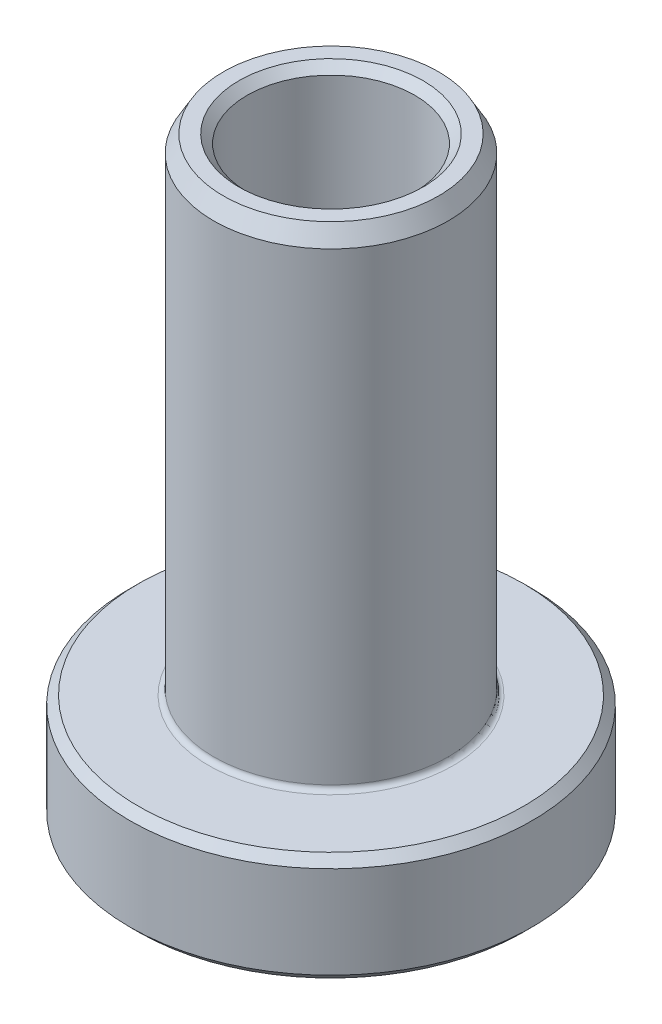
ISO-10303-21;
HEADER;
FILE_DESCRIPTION(('STEP AP214'),'2;1');
FILE_NAME('part.step','',(''),(''),'','','');
FILE_SCHEMA(('AUTOMOTIVE_DESIGN { 1 0 10303 214 1 1 1 1 }'));
ENDSEC;
DATA;
#1=APPLICATION_CONTEXT('core data for automotive mechanical design processes');
#2=APPLICATION_PROTOCOL_DEFINITION('international standard','automotive_design',2000,#1);
#3=PRODUCT_CONTEXT('',#1,'mechanical');
#4=PRODUCT('Part','Part','',(#3));
#5=PRODUCT_RELATED_PRODUCT_CATEGORY('part','',(#4));
#6=PRODUCT_DEFINITION_FORMATION('','',#4);
#7=PRODUCT_DEFINITION_CONTEXT('part definition',#1,'design');
#8=PRODUCT_DEFINITION('design','',#6,#7);
#9=PRODUCT_DEFINITION_SHAPE('','',#8);
#10=(LENGTH_UNIT() NAMED_UNIT(*) SI_UNIT(.MILLI.,.METRE.));
#11=(NAMED_UNIT(*) PLANE_ANGLE_UNIT() SI_UNIT($,.RADIAN.));
#12=(NAMED_UNIT(*) SI_UNIT($,.STERADIAN.) SOLID_ANGLE_UNIT());
#13=UNCERTAINTY_MEASURE_WITH_UNIT(LENGTH_MEASURE(1.E-05),#10,'distance_accuracy_value','');
#14=(GEOMETRIC_REPRESENTATION_CONTEXT(3) GLOBAL_UNCERTAINTY_ASSIGNED_CONTEXT((#13)) GLOBAL_UNIT_ASSIGNED_CONTEXT((#10,
#11,#12)) REPRESENTATION_CONTEXT('',''));
#15=CARTESIAN_POINT('',(0.,0.,0.));
#16=DIRECTION('',(0.,0.,1.));
#17=DIRECTION('',(1.,0.,0.));
#18=AXIS2_PLACEMENT_3D('',#15,#16,#17);
#19=CARTESIAN_POINT('',(0.,48.5159618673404,0.));
#20=DIRECTION('',(0.,1.,0.));
#21=DIRECTION('',(0.,0.,1.));
#22=AXIS2_PLACEMENT_3D('',#19,#20,#21);
#23=CYLINDRICAL_SURFACE('',#22,5.);
#24=CARTESIAN_POINT('',(0.,35.,0.));
#25=DIRECTION('',(0.,-1.,0.));
#26=DIRECTION('',(0.,0.,-1.));
#27=AXIS2_PLACEMENT_3D('',#24,#25,#26);
#28=CIRCLE('',#27,5.);
#29=CARTESIAN_POINT('',(0.,35.,-5.));
#30=VERTEX_POINT('',#29);
#31=EDGE_CURVE('E51',#30,#30,#28,.F.);
#32=ORIENTED_EDGE('',*,*,#31,.T.);
#33=EDGE_LOOP('',(#32));
#34=FACE_BOUND('',#33,.T.);
#35=CARTESIAN_POINT('',(0.,0.5,0.));
#36=DIRECTION('',(0.,1.,0.));
#37=DIRECTION('',(0.,0.,1.));
#38=AXIS2_PLACEMENT_3D('',#35,#36,#37);
#39=CIRCLE('',#38,5.);
#40=CARTESIAN_POINT('',(0.,0.5,5.));
#41=VERTEX_POINT('',#40);
#42=EDGE_CURVE('E54',#41,#41,#39,.F.);
#43=ORIENTED_EDGE('',*,*,#42,.T.);
#44=EDGE_LOOP('',(#43));
#45=FACE_BOUND('',#44,.T.);
#46=ADVANCED_FACE('F26',(#34,#45),#23,.F.);
#47=CARTESIAN_POINT('',(5.,0.,0.));
#48=DIRECTION('',(0.,1.,0.));
#49=DIRECTION('',(0.,0.,1.));
#50=AXIS2_PLACEMENT_3D('',#47,#48,#49);
#51=PLANE('',#50);
#52=CARTESIAN_POINT('',(0.,0.,0.));
#53=DIRECTION('',(0.,1.,0.));
#54=DIRECTION('',(0.,0.,1.));
#55=AXIS2_PLACEMENT_3D('',#52,#53,#54);
#56=CIRCLE('',#55,11.5);
#57=CARTESIAN_POINT('',(0.,0.,11.5));
#58=VERTEX_POINT('',#57);
#59=EDGE_CURVE('E10',#58,#58,#56,.F.);
#60=ORIENTED_EDGE('',*,*,#59,.T.);
#61=EDGE_LOOP('',(#60));
#62=FACE_BOUND('',#61,.T.);
#63=CARTESIAN_POINT('',(0.,0.,0.));
#64=DIRECTION('',(0.,1.,0.));
#65=DIRECTION('',(0.,0.,1.));
#66=AXIS2_PLACEMENT_3D('',#63,#64,#65);
#67=CIRCLE('',#66,5.50000000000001);
#68=CARTESIAN_POINT('',(0.,0.,5.50000000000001));
#69=VERTEX_POINT('',#68);
#70=EDGE_CURVE('E32',#69,#69,#67,.T.);
#71=ORIENTED_EDGE('',*,*,#70,.T.);
#72=EDGE_LOOP('',(#71));
#73=FACE_BOUND('',#72,.T.);
#74=ADVANCED_FACE('F89',(#62,#73),#51,.F.);
#75=CARTESIAN_POINT('',(0.,48.5159618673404,0.));
#76=DIRECTION('',(0.,1.,0.));
#77=DIRECTION('',(0.,0.,1.));
#78=AXIS2_PLACEMENT_3D('',#75,#76,#77);
#79=CYLINDRICAL_SURFACE('',#78,12.);
#80=CARTESIAN_POINT('',(0.,6.,0.));
#81=DIRECTION('',(0.,-1.,0.));
#82=DIRECTION('',(0.,0.,-1.));
#83=AXIS2_PLACEMENT_3D('',#80,#81,#82);
#84=CIRCLE('',#83,12.);
#85=CARTESIAN_POINT('',(0.,6.,-12.));
#86=VERTEX_POINT('',#85);
#87=EDGE_CURVE('E36',#86,#86,#84,.T.);
#88=ORIENTED_EDGE('',*,*,#87,.T.);
#89=EDGE_LOOP('',(#88));
#90=FACE_BOUND('',#89,.T.);
#91=CARTESIAN_POINT('',(0.,0.500000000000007,0.));
#92=DIRECTION('',(0.,1.,0.));
#93=DIRECTION('',(0.,0.,1.));
#94=AXIS2_PLACEMENT_3D('',#91,#92,#93);
#95=CIRCLE('',#94,12.);
#96=CARTESIAN_POINT('',(0.,0.500000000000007,12.));
#97=VERTEX_POINT('',#96);
#98=EDGE_CURVE('E40',#97,#97,#95,.T.);
#99=ORIENTED_EDGE('',*,*,#98,.T.);
#100=EDGE_LOOP('',(#99));
#101=FACE_BOUND('',#100,.T.);
#102=ADVANCED_FACE('F94',(#90,#101),#79,.T.);
#103=CARTESIAN_POINT('',(12.,6.5,0.));
#104=DIRECTION('',(0.,-1.,0.));
#105=DIRECTION('',(0.,0.,-1.));
#106=AXIS2_PLACEMENT_3D('',#103,#104,#105);
#107=PLANE('',#106);
#108=CARTESIAN_POINT('',(0.,6.5,0.));
#109=DIRECTION('',(0.,-1.,0.));
#110=DIRECTION('',(0.,0.,-1.));
#111=AXIS2_PLACEMENT_3D('',#108,#109,#110);
#112=CIRCLE('',#111,11.5);
#113=CARTESIAN_POINT('',(0.,6.5,-11.5));
#114=VERTEX_POINT('',#113);
#115=EDGE_CURVE('E45',#114,#114,#112,.F.);
#116=ORIENTED_EDGE('',*,*,#115,.T.);
#117=EDGE_LOOP('',(#116));
#118=FACE_BOUND('',#117,.T.);
#119=CARTESIAN_POINT('',(0.,6.5,0.));
#120=DIRECTION('',(0.,-1.,0.));
#121=DIRECTION('',(0.,0.,-1.));
#122=AXIS2_PLACEMENT_3D('',#119,#120,#121);
#123=CIRCLE('',#122,7.3);
#124=CARTESIAN_POINT('',(0.,6.5,-7.3));
#125=VERTEX_POINT('',#124);
#126=EDGE_CURVE('E63',#125,#125,#123,.T.);
#127=ORIENTED_EDGE('',*,*,#126,.T.);
#128=EDGE_LOOP('',(#127));
#129=FACE_BOUND('',#128,.T.);
#130=ADVANCED_FACE('F150',(#118,#129),#107,.F.);
#131=CARTESIAN_POINT('',(0.,48.5159618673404,0.));
#132=DIRECTION('',(0.,1.,0.));
#133=DIRECTION('',(0.,0.,1.));
#134=AXIS2_PLACEMENT_3D('',#131,#132,#133);
#135=CYLINDRICAL_SURFACE('',#134,7.);
#136=CARTESIAN_POINT('',(0.,34.5,0.));
#137=DIRECTION('',(0.,-1.,0.));
#138=DIRECTION('',(0.,0.,-1.));
#139=AXIS2_PLACEMENT_3D('',#136,#137,#138);
#140=CIRCLE('',#139,7.);
#141=CARTESIAN_POINT('',(0.,34.5,-7.));
#142=VERTEX_POINT('',#141);
#143=EDGE_CURVE('E57',#142,#142,#140,.T.);
#144=ORIENTED_EDGE('',*,*,#143,.T.);
#145=EDGE_LOOP('',(#144));
#146=FACE_BOUND('',#145,.T.);
#147=CARTESIAN_POINT('',(0.,6.8,0.));
#148=DIRECTION('',(0.,-1.,0.));
#149=DIRECTION('',(0.,0.,-1.));
#150=AXIS2_PLACEMENT_3D('',#147,#148,#149);
#151=CIRCLE('',#150,7.);
#152=CARTESIAN_POINT('',(0.,6.8,-7.));
#153=VERTEX_POINT('',#152);
#154=EDGE_CURVE('E66',#153,#153,#151,.F.);
#155=ORIENTED_EDGE('',*,*,#154,.T.);
#156=EDGE_LOOP('',(#155));
#157=FACE_BOUND('',#156,.T.);
#158=ADVANCED_FACE('F70',(#146,#157),#135,.T.);
#159=CARTESIAN_POINT('',(6.99999999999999,35.5,0.));
#160=DIRECTION('',(0.,-1.,0.));
#161=DIRECTION('',(0.,0.,-1.));
#162=AXIS2_PLACEMENT_3D('',#159,#160,#161);
#163=PLANE('',#162);
#164=CARTESIAN_POINT('',(0.,35.5,0.));
#165=DIRECTION('',(0.,-1.,0.));
#166=DIRECTION('',(0.,0.,-1.));
#167=AXIS2_PLACEMENT_3D('',#164,#165,#166);
#168=CIRCLE('',#167,5.5);
#169=CARTESIAN_POINT('',(0.,35.5,-5.5));
#170=VERTEX_POINT('',#169);
#171=EDGE_CURVE('E48',#170,#170,#168,.T.);
#172=ORIENTED_EDGE('',*,*,#171,.T.);
#173=EDGE_LOOP('',(#172));
#174=FACE_BOUND('',#173,.T.);
#175=CARTESIAN_POINT('',(0.,35.5,0.));
#176=DIRECTION('',(0.,-1.,0.));
#177=DIRECTION('',(0.,0.,-1.));
#178=AXIS2_PLACEMENT_3D('',#175,#176,#177);
#179=CIRCLE('',#178,6.42264973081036);
#180=CARTESIAN_POINT('',(0.,35.5,-6.42264973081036));
#181=VERTEX_POINT('',#180);
#182=EDGE_CURVE('E60',#181,#181,#179,.F.);
#183=ORIENTED_EDGE('',*,*,#182,.T.);
#184=EDGE_LOOP('',(#183));
#185=FACE_BOUND('',#184,.T.);
#186=ADVANCED_FACE('F75',(#174,#185),#163,.F.);
#187=CARTESIAN_POINT('',(0.,6.8,0.));
#188=DIRECTION('',(0.,-1.,0.));
#189=DIRECTION('',(0.,0.,-1.));
#190=AXIS2_PLACEMENT_3D('',#187,#188,#189);
#191=TOROIDAL_SURFACE('',#190,7.3,0.3);
#192=ORIENTED_EDGE('',*,*,#126,.F.);
#193=EDGE_LOOP('',(#192));
#194=FACE_BOUND('',#193,.T.);
#195=ORIENTED_EDGE('',*,*,#154,.F.);
#196=EDGE_LOOP('',(#195));
#197=FACE_BOUND('',#196,.T.);
#198=ADVANCED_FACE('F72',(#194,#197),#191,.F.);
#199=CARTESIAN_POINT('',(0.,35.5,0.));
#200=DIRECTION('',(0.,-1.,0.));
#201=DIRECTION('',(0.,0.,-1.));
#202=AXIS2_PLACEMENT_3D('',#199,#200,#201);
#203=CONICAL_SURFACE('',#202,6.42264973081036,0.523598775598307);
#204=ORIENTED_EDGE('',*,*,#143,.F.);
#205=EDGE_LOOP('',(#204));
#206=FACE_BOUND('',#205,.T.);
#207=ORIENTED_EDGE('',*,*,#182,.F.);
#208=EDGE_LOOP('',(#207));
#209=FACE_BOUND('',#208,.T.);
#210=ADVANCED_FACE('F74',(#206,#209),#203,.T.);
#211=CARTESIAN_POINT('',(0.,35.,0.));
#212=DIRECTION('',(0.,1.,0.));
#213=DIRECTION('',(0.,0.,1.));
#214=AXIS2_PLACEMENT_3D('',#211,#212,#213);
#215=CONICAL_SURFACE('',#214,5.,0.785398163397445);
#216=ORIENTED_EDGE('',*,*,#171,.F.);
#217=EDGE_LOOP('',(#216));
#218=FACE_BOUND('',#217,.T.);
#219=ORIENTED_EDGE('',*,*,#31,.F.);
#220=EDGE_LOOP('',(#219));
#221=FACE_BOUND('',#220,.T.);
#222=ADVANCED_FACE('F82',(#218,#221),#215,.F.);
#223=CARTESIAN_POINT('',(0.,6.5,0.));
#224=DIRECTION('',(0.,-1.,0.));
#225=DIRECTION('',(0.,0.,-1.));
#226=AXIS2_PLACEMENT_3D('',#223,#224,#225);
#227=CONICAL_SURFACE('',#226,11.5,0.785398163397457);
#228=ORIENTED_EDGE('',*,*,#87,.F.);
#229=EDGE_LOOP('',(#228));
#230=FACE_BOUND('',#229,.T.);
#231=ORIENTED_EDGE('',*,*,#115,.F.);
#232=EDGE_LOOP('',(#231));
#233=FACE_BOUND('',#232,.T.);
#234=ADVANCED_FACE('F107',(#230,#233),#227,.T.);
#235=CARTESIAN_POINT('',(0.,0.500000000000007,0.));
#236=DIRECTION('',(0.,1.,0.));
#237=DIRECTION('',(0.,0.,1.));
#238=AXIS2_PLACEMENT_3D('',#235,#236,#237);
#239=CONICAL_SURFACE('',#238,12.,0.785398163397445);
#240=ORIENTED_EDGE('',*,*,#59,.F.);
#241=EDGE_LOOP('',(#240));
#242=FACE_BOUND('',#241,.T.);
#243=ORIENTED_EDGE('',*,*,#98,.F.);
#244=EDGE_LOOP('',(#243));
#245=FACE_BOUND('',#244,.T.);
#246=ADVANCED_FACE('F102',(#242,#245),#239,.T.);
#247=CARTESIAN_POINT('',(0.,0.,0.));
#248=DIRECTION('',(0.,-1.,0.));
#249=DIRECTION('',(0.,0.,-1.));
#250=AXIS2_PLACEMENT_3D('',#247,#248,#249);
#251=CONICAL_SURFACE('',#250,5.50000000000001,0.785398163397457);
#252=ORIENTED_EDGE('',*,*,#42,.F.);
#253=EDGE_LOOP('',(#252));
#254=FACE_BOUND('',#253,.T.);
#255=ORIENTED_EDGE('',*,*,#70,.F.);
#256=EDGE_LOOP('',(#255));
#257=FACE_BOUND('',#256,.T.);
#258=ADVANCED_FACE('F99',(#254,#257),#251,.F.);
#259=CLOSED_SHELL('',(#46,#74,#102,#130,#158,#186,#198,#210,#222,#234,#246,#258));
#260=MANIFOLD_SOLID_BREP('B2',#259);
#261=ADVANCED_BREP_SHAPE_REPRESENTATION('',(#18,#260),#14);
#262=SHAPE_DEFINITION_REPRESENTATION(#9,#261);
ENDSEC;
END-ISO-10303-21;
